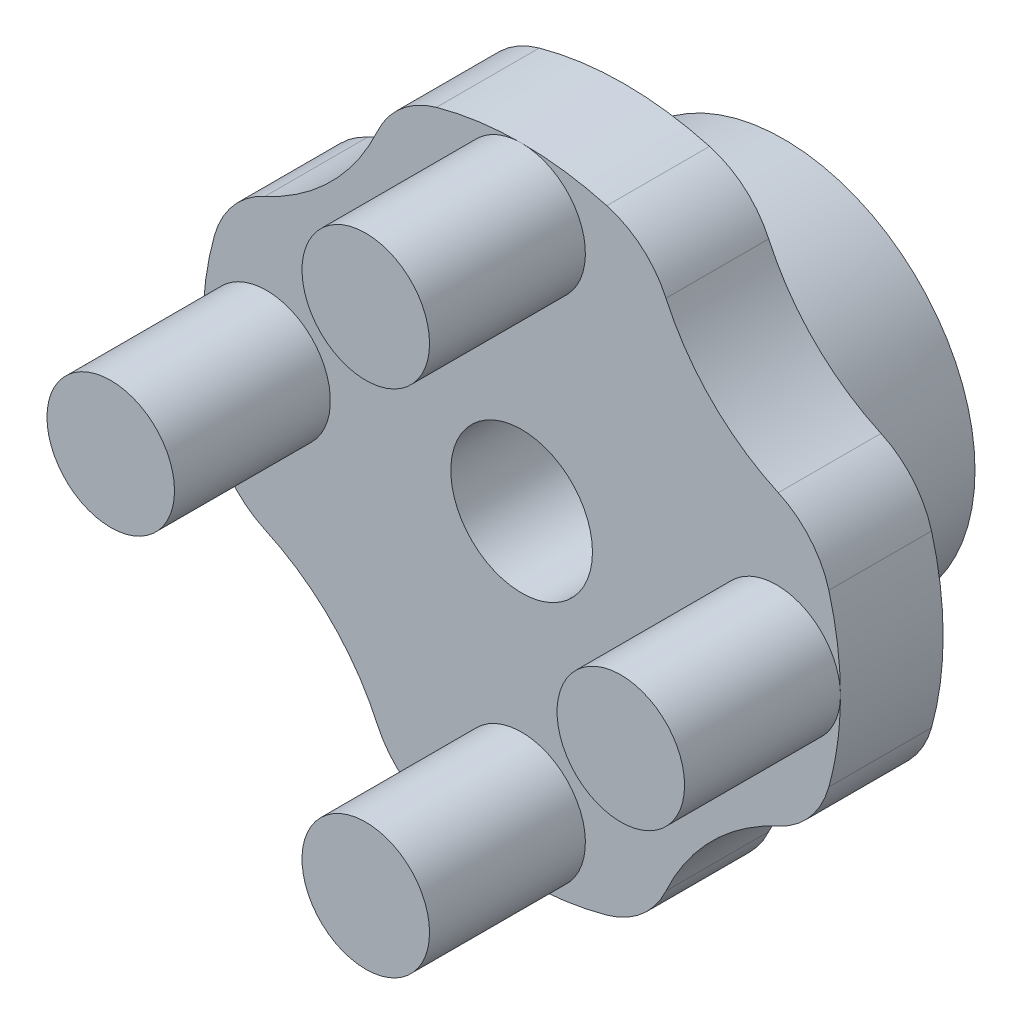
ISO-10303-21;
HEADER;
FILE_DESCRIPTION(('STEP AP214'),'2;1');
FILE_NAME('part.step','',(''),(''),'','','');
FILE_SCHEMA(('AUTOMOTIVE_DESIGN { 1 0 10303 214 1 1 1 1 }'));
ENDSEC;
DATA;
#1=APPLICATION_CONTEXT('core data for automotive mechanical design processes');
#2=APPLICATION_PROTOCOL_DEFINITION('international standard','automotive_design',2000,#1);
#3=PRODUCT_CONTEXT('',#1,'mechanical');
#4=PRODUCT('Part','Part','',(#3));
#5=PRODUCT_RELATED_PRODUCT_CATEGORY('part','',(#4));
#6=PRODUCT_DEFINITION_FORMATION('','',#4);
#7=PRODUCT_DEFINITION_CONTEXT('part definition',#1,'design');
#8=PRODUCT_DEFINITION('design','',#6,#7);
#9=PRODUCT_DEFINITION_SHAPE('','',#8);
#10=(LENGTH_UNIT() NAMED_UNIT(*) SI_UNIT(.MILLI.,.METRE.));
#11=(NAMED_UNIT(*) PLANE_ANGLE_UNIT() SI_UNIT($,.RADIAN.));
#12=(NAMED_UNIT(*) SI_UNIT($,.STERADIAN.) SOLID_ANGLE_UNIT());
#13=UNCERTAINTY_MEASURE_WITH_UNIT(LENGTH_MEASURE(1.E-05),#10,'distance_accuracy_value','');
#14=(GEOMETRIC_REPRESENTATION_CONTEXT(3) GLOBAL_UNCERTAINTY_ASSIGNED_CONTEXT((#13)) GLOBAL_UNIT_ASSIGNED_CONTEXT((#10,
#11,#12)) REPRESENTATION_CONTEXT('',''));
#15=CARTESIAN_POINT('',(0.,0.,0.));
#16=DIRECTION('',(0.,0.,1.));
#17=DIRECTION('',(1.,0.,0.));
#18=AXIS2_PLACEMENT_3D('',#15,#16,#17);
#19=CARTESIAN_POINT('',(0.,0.,90.));
#20=DIRECTION('',(0.,0.,1.));
#21=DIRECTION('',(1.,0.,0.));
#22=AXIS2_PLACEMENT_3D('',#19,#20,#21);
#23=CYLINDRICAL_SURFACE('',#22,45.);
#24=CARTESIAN_POINT('',(0.,0.,22.5));
#25=DIRECTION('',(0.,0.,1.));
#26=DIRECTION('',(1.,0.,0.));
#27=AXIS2_PLACEMENT_3D('',#24,#25,#26);
#28=CIRCLE('',#27,45.);
#29=CARTESIAN_POINT('',(-43.3644250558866,12.021923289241,22.5));
#30=VERTEX_POINT('',#29);
#31=CARTESIAN_POINT('',(-43.3644250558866,-12.0219232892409,22.5));
#32=VERTEX_POINT('',#31);
#33=EDGE_CURVE('E171',#30,#32,#28,.T.);
#34=ORIENTED_EDGE('',*,*,#33,.T.);
#35=DIRECTION('',(0.,0.,1.));
#36=VECTOR('',#35,1.);
#37=CARTESIAN_POINT('',(-43.3644250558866,-12.0219232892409,90.));
#38=LINE('',#37,#36);
#39=CARTESIAN_POINT('',(-43.3644250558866,-12.0219232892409,37.));
#40=VERTEX_POINT('',#39);
#41=EDGE_CURVE('E225',#32,#40,#38,.T.);
#42=ORIENTED_EDGE('',*,*,#41,.T.);
#43=CARTESIAN_POINT('',(0.,0.,37.));
#44=DIRECTION('',(0.,0.,1.));
#45=DIRECTION('',(1.,0.,0.));
#46=AXIS2_PLACEMENT_3D('',#43,#44,#45);
#47=CIRCLE('',#46,45.);
#48=CARTESIAN_POINT('',(-45.,0.,37.));
#49=VERTEX_POINT('',#48);
#50=EDGE_CURVE('E161',#49,#40,#47,.T.);
#51=ORIENTED_EDGE('',*,*,#50,.F.);
#52=CARTESIAN_POINT('',(-43.3644250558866,12.021923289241,37.));
#53=VERTEX_POINT('',#52);
#54=EDGE_CURVE('E157',#53,#49,#47,.T.);
#55=ORIENTED_EDGE('',*,*,#54,.F.);
#56=DIRECTION('',(0.,0.,1.));
#57=VECTOR('',#56,1.);
#58=CARTESIAN_POINT('',(-43.3644250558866,12.021923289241,90.));
#59=LINE('',#58,#57);
#60=EDGE_CURVE('E223',#53,#30,#59,.F.);
#61=ORIENTED_EDGE('',*,*,#60,.T.);
#62=EDGE_LOOP('',(#34,#42,#51,#55,#61));
#63=FACE_BOUND('',#62,.T.);
#64=ADVANCED_FACE('F14',(#63),#23,.T.);
#65=CARTESIAN_POINT('',(-45.,0.,37.));
#66=DIRECTION('',(0.,0.,-1.));
#67=DIRECTION('',(-1.,0.,0.));
#68=AXIS2_PLACEMENT_3D('',#65,#66,#67);
#69=PLANE('',#68);
#70=CARTESIAN_POINT('',(0.,0.,37.));
#71=DIRECTION('',(0.,0.,1.));
#72=DIRECTION('',(1.,0.,0.));
#73=AXIS2_PLACEMENT_3D('',#70,#71,#72);
#74=CIRCLE('',#73,10.);
#75=CARTESIAN_POINT('',(10.,0.,37.));
#76=VERTEX_POINT('',#75);
#77=EDGE_CURVE('E319',#76,#76,#74,.T.);
#78=ORIENTED_EDGE('',*,*,#77,.F.);
#79=EDGE_LOOP('',(#78));
#80=FACE_BOUND('',#79,.T.);
#81=CARTESIAN_POINT('',(0.,-45.,37.));
#82=VERTEX_POINT('',#81);
#83=CARTESIAN_POINT('',(12.021923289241,-43.3644250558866,37.));
#84=VERTEX_POINT('',#83);
#85=EDGE_CURVE('E147',#82,#84,#47,.T.);
#86=ORIENTED_EDGE('',*,*,#85,.T.);
#87=CARTESIAN_POINT('',(8.54892322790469,-30.836924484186,37.));
#88=DIRECTION('',(0.,0.,-1.));
#89=DIRECTION('',(-1.,0.,0.));
#90=AXIS2_PLACEMENT_3D('',#87,#88,#89);
#91=CIRCLE('',#90,13.);
#92=CARTESIAN_POINT('',(20.3785047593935,-36.2277500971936,37.));
#93=VERTEX_POINT('',#92);
#94=EDGE_CURVE('E246',#84,#93,#91,.F.);
#95=ORIENTED_EDGE('',*,*,#94,.T.);
#96=CARTESIAN_POINT('',(49.4974746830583,-49.4974746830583,37.));
#97=DIRECTION('',(0.,0.,1.));
#98=DIRECTION('',(1.,0.,0.));
#99=AXIS2_PLACEMENT_3D('',#96,#97,#98);
#100=CIRCLE('',#99,32.);
#101=CARTESIAN_POINT('',(36.2277500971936,-20.3785047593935,37.));
#102=VERTEX_POINT('',#101);
#103=EDGE_CURVE('E285',#102,#93,#100,.T.);
#104=ORIENTED_EDGE('',*,*,#103,.F.);
#105=CARTESIAN_POINT('',(30.836924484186,-8.54892322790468,37.));
#106=DIRECTION('',(0.,0.,-1.));
#107=DIRECTION('',(-1.,0.,0.));
#108=AXIS2_PLACEMENT_3D('',#105,#106,#107);
#109=CIRCLE('',#108,13.);
#110=CARTESIAN_POINT('',(43.3644250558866,-12.021923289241,37.));
#111=VERTEX_POINT('',#110);
#112=EDGE_CURVE('E146',#102,#111,#109,.F.);
#113=ORIENTED_EDGE('',*,*,#112,.T.);
#114=CARTESIAN_POINT('',(45.,0.,37.));
#115=VERTEX_POINT('',#114);
#116=EDGE_CURVE('E139',#111,#115,#47,.T.);
#117=ORIENTED_EDGE('',*,*,#116,.T.);
#118=CARTESIAN_POINT('',(36.,0.,37.));
#119=DIRECTION('',(0.,0.,1.));
#120=DIRECTION('',(1.,0.,0.));
#121=AXIS2_PLACEMENT_3D('',#118,#119,#120);
#122=CIRCLE('',#121,9.);
#123=EDGE_CURVE('E144',#115,#115,#122,.T.);
#124=ORIENTED_EDGE('',*,*,#123,.F.);
#125=CARTESIAN_POINT('',(43.3644250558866,12.021923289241,37.));
#126=VERTEX_POINT('',#125);
#127=EDGE_CURVE('E148',#115,#126,#47,.T.);
#128=ORIENTED_EDGE('',*,*,#127,.T.);
#129=CARTESIAN_POINT('',(30.836924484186,8.5489232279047,37.));
#130=DIRECTION('',(0.,0.,-1.));
#131=DIRECTION('',(-1.,0.,0.));
#132=AXIS2_PLACEMENT_3D('',#129,#130,#131);
#133=CIRCLE('',#132,13.);
#134=CARTESIAN_POINT('',(36.2277500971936,20.3785047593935,37.));
#135=VERTEX_POINT('',#134);
#136=EDGE_CURVE('E207',#126,#135,#133,.F.);
#137=ORIENTED_EDGE('',*,*,#136,.T.);
#138=CARTESIAN_POINT('',(49.4974746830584,49.4974746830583,37.));
#139=DIRECTION('',(0.,0.,-1.));
#140=DIRECTION('',(-1.,0.,0.));
#141=AXIS2_PLACEMENT_3D('',#138,#139,#140);
#142=CIRCLE('',#141,32.);
#143=CARTESIAN_POINT('',(20.3785047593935,36.2277500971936,37.));
#144=VERTEX_POINT('',#143);
#145=EDGE_CURVE('E290',#135,#144,#142,.T.);
#146=ORIENTED_EDGE('',*,*,#145,.T.);
#147=CARTESIAN_POINT('',(8.5489232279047,30.836924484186,37.));
#148=DIRECTION('',(0.,0.,-1.));
#149=DIRECTION('',(-1.,0.,0.));
#150=AXIS2_PLACEMENT_3D('',#147,#148,#149);
#151=CIRCLE('',#150,13.);
#152=CARTESIAN_POINT('',(12.021923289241,43.3644250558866,37.));
#153=VERTEX_POINT('',#152);
#154=EDGE_CURVE('E203',#144,#153,#151,.F.);
#155=ORIENTED_EDGE('',*,*,#154,.T.);
#156=CARTESIAN_POINT('',(0.,45.,37.));
#157=VERTEX_POINT('',#156);
#158=EDGE_CURVE('E155',#153,#157,#47,.T.);
#159=ORIENTED_EDGE('',*,*,#158,.T.);
#160=CARTESIAN_POINT('',(0.,36.,37.));
#161=DIRECTION('',(0.,0.,1.));
#162=DIRECTION('',(1.,0.,0.));
#163=AXIS2_PLACEMENT_3D('',#160,#161,#162);
#164=CIRCLE('',#163,9.);
#165=EDGE_CURVE('E277',#157,#157,#164,.T.);
#166=ORIENTED_EDGE('',*,*,#165,.F.);
#167=CARTESIAN_POINT('',(-12.021923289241,43.3644250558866,37.));
#168=VERTEX_POINT('',#167);
#169=EDGE_CURVE('E156',#157,#168,#47,.T.);
#170=ORIENTED_EDGE('',*,*,#169,.T.);
#171=CARTESIAN_POINT('',(-8.54892322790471,30.836924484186,37.));
#172=DIRECTION('',(0.,0.,-1.));
#173=DIRECTION('',(-1.,0.,0.));
#174=AXIS2_PLACEMENT_3D('',#171,#172,#173);
#175=CIRCLE('',#174,13.);
#176=CARTESIAN_POINT('',(-20.3785047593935,36.2277500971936,37.));
#177=VERTEX_POINT('',#176);
#178=EDGE_CURVE('E202',#168,#177,#175,.F.);
#179=ORIENTED_EDGE('',*,*,#178,.T.);
#180=CARTESIAN_POINT('',(-49.4974746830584,49.4974746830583,37.));
#181=DIRECTION('',(0.,0.,1.));
#182=DIRECTION('',(1.,0.,0.));
#183=AXIS2_PLACEMENT_3D('',#180,#181,#182);
#184=CIRCLE('',#183,32.);
#185=CARTESIAN_POINT('',(-36.2277500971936,20.3785047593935,37.));
#186=VERTEX_POINT('',#185);
#187=EDGE_CURVE('E302',#186,#177,#184,.T.);
#188=ORIENTED_EDGE('',*,*,#187,.F.);
#189=CARTESIAN_POINT('',(-30.836924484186,8.5489232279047,37.));
#190=DIRECTION('',(0.,0.,-1.));
#191=DIRECTION('',(-1.,0.,0.));
#192=AXIS2_PLACEMENT_3D('',#189,#190,#191);
#193=CIRCLE('',#192,13.);
#194=EDGE_CURVE('E309',#186,#53,#193,.F.);
#195=ORIENTED_EDGE('',*,*,#194,.T.);
#196=ORIENTED_EDGE('',*,*,#54,.T.);
#197=CARTESIAN_POINT('',(-36.,0.,37.));
#198=DIRECTION('',(0.,0.,1.));
#199=DIRECTION('',(1.,0.,0.));
#200=AXIS2_PLACEMENT_3D('',#197,#198,#199);
#201=CIRCLE('',#200,9.);
#202=EDGE_CURVE('E269',#49,#49,#201,.T.);
#203=ORIENTED_EDGE('',*,*,#202,.F.);
#204=ORIENTED_EDGE('',*,*,#50,.T.);
#205=CARTESIAN_POINT('',(-30.836924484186,-8.54892322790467,37.));
#206=DIRECTION('',(0.,0.,-1.));
#207=DIRECTION('',(-1.,0.,0.));
#208=AXIS2_PLACEMENT_3D('',#205,#206,#207);
#209=CIRCLE('',#208,13.);
#210=CARTESIAN_POINT('',(-36.2277500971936,-20.3785047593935,37.));
#211=VERTEX_POINT('',#210);
#212=EDGE_CURVE('E230',#40,#211,#209,.F.);
#213=ORIENTED_EDGE('',*,*,#212,.T.);
#214=CARTESIAN_POINT('',(-49.4974746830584,-49.4974746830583,37.));
#215=DIRECTION('',(0.,0.,-1.));
#216=DIRECTION('',(-1.,0.,0.));
#217=AXIS2_PLACEMENT_3D('',#214,#215,#216);
#218=CIRCLE('',#217,32.);
#219=CARTESIAN_POINT('',(-20.3785047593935,-36.2277500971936,37.));
#220=VERTEX_POINT('',#219);
#221=EDGE_CURVE('E296',#211,#220,#218,.T.);
#222=ORIENTED_EDGE('',*,*,#221,.T.);
#223=CARTESIAN_POINT('',(-8.54892322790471,-30.836924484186,37.));
#224=DIRECTION('',(0.,0.,-1.));
#225=DIRECTION('',(-1.,0.,0.));
#226=AXIS2_PLACEMENT_3D('',#223,#224,#225);
#227=CIRCLE('',#226,13.);
#228=CARTESIAN_POINT('',(-12.021923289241,-43.3644250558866,37.));
#229=VERTEX_POINT('',#228);
#230=EDGE_CURVE('E228',#220,#229,#227,.F.);
#231=ORIENTED_EDGE('',*,*,#230,.T.);
#232=EDGE_CURVE('E150',#229,#82,#47,.T.);
#233=ORIENTED_EDGE('',*,*,#232,.T.);
#234=CARTESIAN_POINT('',(0.,-36.,37.));
#235=DIRECTION('',(0.,0.,1.));
#236=DIRECTION('',(1.,0.,0.));
#237=AXIS2_PLACEMENT_3D('',#234,#235,#236);
#238=CIRCLE('',#237,9.);
#239=EDGE_CURVE('E263',#82,#82,#238,.T.);
#240=ORIENTED_EDGE('',*,*,#239,.F.);
#241=EDGE_LOOP('',(#86,#95,#104,#113,#117,#124,#128,#137,#146,#155,#159,#166,#170,#179,#188,
#195,#196,#203,#204,#213,#222,#231,#233,#240));
#242=FACE_BOUND('',#241,.T.);
#243=ADVANCED_FACE('F16',(#80,#242),#69,.F.);
#244=CARTESIAN_POINT('',(-28.5,0.,22.5));
#245=DIRECTION('',(0.,0.,1.));
#246=DIRECTION('',(1.,0.,0.));
#247=AXIS2_PLACEMENT_3D('',#244,#245,#246);
#248=PLANE('',#247);
#249=CARTESIAN_POINT('',(0.,0.,22.5));
#250=DIRECTION('',(0.,0.,1.));
#251=DIRECTION('',(1.,0.,0.));
#252=AXIS2_PLACEMENT_3D('',#249,#250,#251);
#253=CIRCLE('',#252,28.5);
#254=CARTESIAN_POINT('',(28.5,0.,22.5));
#255=VERTEX_POINT('',#254);
#256=EDGE_CURVE('E180',#255,#255,#253,.T.);
#257=ORIENTED_EDGE('',*,*,#256,.T.);
#258=EDGE_LOOP('',(#257));
#259=FACE_BOUND('',#258,.T.);
#260=CARTESIAN_POINT('',(49.4974746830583,-49.4974746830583,22.5));
#261=DIRECTION('',(0.,0.,1.));
#262=DIRECTION('',(1.,0.,0.));
#263=AXIS2_PLACEMENT_3D('',#260,#261,#262);
#264=CIRCLE('',#263,32.);
#265=CARTESIAN_POINT('',(36.2277500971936,-20.3785047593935,22.5));
#266=VERTEX_POINT('',#265);
#267=CARTESIAN_POINT('',(20.3785047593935,-36.2277500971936,22.5));
#268=VERTEX_POINT('',#267);
#269=EDGE_CURVE('E256',#266,#268,#264,.T.);
#270=ORIENTED_EDGE('',*,*,#269,.T.);
#271=CARTESIAN_POINT('',(8.54892322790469,-30.836924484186,22.5));
#272=DIRECTION('',(0.,0.,1.));
#273=DIRECTION('',(1.,0.,0.));
#274=AXIS2_PLACEMENT_3D('',#271,#272,#273);
#275=CIRCLE('',#274,13.);
#276=CARTESIAN_POINT('',(12.021923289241,-43.3644250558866,22.5));
#277=VERTEX_POINT('',#276);
#278=EDGE_CURVE('E22',#268,#277,#275,.F.);
#279=ORIENTED_EDGE('',*,*,#278,.T.);
#280=CARTESIAN_POINT('',(-12.021923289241,-43.3644250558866,22.5));
#281=VERTEX_POINT('',#280);
#282=EDGE_CURVE('E167',#281,#277,#28,.T.);
#283=ORIENTED_EDGE('',*,*,#282,.F.);
#284=CARTESIAN_POINT('',(-8.54892322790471,-30.836924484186,22.5));
#285=DIRECTION('',(0.,0.,1.));
#286=DIRECTION('',(1.,0.,0.));
#287=AXIS2_PLACEMENT_3D('',#284,#285,#286);
#288=CIRCLE('',#287,13.);
#289=CARTESIAN_POINT('',(-20.3785047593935,-36.2277500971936,22.5));
#290=VERTEX_POINT('',#289);
#291=EDGE_CURVE('E237',#281,#290,#288,.F.);
#292=ORIENTED_EDGE('',*,*,#291,.T.);
#293=CARTESIAN_POINT('',(-49.4974746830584,-49.4974746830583,22.5));
#294=DIRECTION('',(0.,0.,1.));
#295=DIRECTION('',(1.,0.,0.));
#296=AXIS2_PLACEMENT_3D('',#293,#294,#295);
#297=CIRCLE('',#296,32.);
#298=CARTESIAN_POINT('',(-36.2277500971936,-20.3785047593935,22.5));
#299=VERTEX_POINT('',#298);
#300=EDGE_CURVE('E293',#299,#290,#297,.F.);
#301=ORIENTED_EDGE('',*,*,#300,.F.);
#302=CARTESIAN_POINT('',(-30.836924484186,-8.54892322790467,22.5));
#303=DIRECTION('',(0.,0.,1.));
#304=DIRECTION('',(1.,0.,0.));
#305=AXIS2_PLACEMENT_3D('',#302,#303,#304);
#306=CIRCLE('',#305,13.);
#307=EDGE_CURVE('E239',#299,#32,#306,.F.);
#308=ORIENTED_EDGE('',*,*,#307,.T.);
#309=ORIENTED_EDGE('',*,*,#33,.F.);
#310=CARTESIAN_POINT('',(-30.836924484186,8.5489232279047,22.5));
#311=DIRECTION('',(0.,0.,1.));
#312=DIRECTION('',(1.,0.,0.));
#313=AXIS2_PLACEMENT_3D('',#310,#311,#312);
#314=CIRCLE('',#313,13.);
#315=CARTESIAN_POINT('',(-36.2277500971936,20.3785047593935,22.5));
#316=VERTEX_POINT('',#315);
#317=EDGE_CURVE('E205',#30,#316,#314,.F.);
#318=ORIENTED_EDGE('',*,*,#317,.T.);
#319=CARTESIAN_POINT('',(-49.4974746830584,49.4974746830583,22.5));
#320=DIRECTION('',(0.,0.,1.));
#321=DIRECTION('',(1.,0.,0.));
#322=AXIS2_PLACEMENT_3D('',#319,#320,#321);
#323=CIRCLE('',#322,32.);
#324=CARTESIAN_POINT('',(-20.3785047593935,36.2277500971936,22.5));
#325=VERTEX_POINT('',#324);
#326=EDGE_CURVE('E299',#316,#325,#323,.T.);
#327=ORIENTED_EDGE('',*,*,#326,.T.);
#328=CARTESIAN_POINT('',(-8.54892322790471,30.836924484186,22.5));
#329=DIRECTION('',(0.,0.,1.));
#330=DIRECTION('',(1.,0.,0.));
#331=AXIS2_PLACEMENT_3D('',#328,#329,#330);
#332=CIRCLE('',#331,13.);
#333=CARTESIAN_POINT('',(-12.021923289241,43.3644250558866,22.5));
#334=VERTEX_POINT('',#333);
#335=EDGE_CURVE('E201',#325,#334,#332,.F.);
#336=ORIENTED_EDGE('',*,*,#335,.T.);
#337=CARTESIAN_POINT('',(12.021923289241,43.3644250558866,22.5));
#338=VERTEX_POINT('',#337);
#339=EDGE_CURVE('E178',#338,#334,#28,.T.);
#340=ORIENTED_EDGE('',*,*,#339,.F.);
#341=CARTESIAN_POINT('',(8.5489232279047,30.836924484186,22.5));
#342=DIRECTION('',(0.,0.,1.));
#343=DIRECTION('',(1.,0.,0.));
#344=AXIS2_PLACEMENT_3D('',#341,#342,#343);
#345=CIRCLE('',#344,13.);
#346=CARTESIAN_POINT('',(20.3785047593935,36.2277500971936,22.5));
#347=VERTEX_POINT('',#346);
#348=EDGE_CURVE('E215',#338,#347,#345,.F.);
#349=ORIENTED_EDGE('',*,*,#348,.T.);
#350=CARTESIAN_POINT('',(49.4974746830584,49.4974746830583,22.5));
#351=DIRECTION('',(0.,0.,1.));
#352=DIRECTION('',(1.,0.,0.));
#353=AXIS2_PLACEMENT_3D('',#350,#351,#352);
#354=CIRCLE('',#353,32.);
#355=CARTESIAN_POINT('',(36.2277500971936,20.3785047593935,22.5));
#356=VERTEX_POINT('',#355);
#357=EDGE_CURVE('E287',#356,#347,#354,.F.);
#358=ORIENTED_EDGE('',*,*,#357,.F.);
#359=CARTESIAN_POINT('',(30.836924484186,8.5489232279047,22.5));
#360=DIRECTION('',(0.,0.,1.));
#361=DIRECTION('',(1.,0.,0.));
#362=AXIS2_PLACEMENT_3D('',#359,#360,#361);
#363=CIRCLE('',#362,13.);
#364=CARTESIAN_POINT('',(43.3644250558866,12.021923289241,22.5));
#365=VERTEX_POINT('',#364);
#366=EDGE_CURVE('E213',#356,#365,#363,.F.);
#367=ORIENTED_EDGE('',*,*,#366,.T.);
#368=CARTESIAN_POINT('',(43.3644250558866,-12.021923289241,22.5));
#369=VERTEX_POINT('',#368);
#370=EDGE_CURVE('E172',#369,#365,#28,.T.);
#371=ORIENTED_EDGE('',*,*,#370,.F.);
#372=CARTESIAN_POINT('',(30.836924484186,-8.54892322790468,22.5));
#373=DIRECTION('',(0.,0.,1.));
#374=DIRECTION('',(1.,0.,0.));
#375=AXIS2_PLACEMENT_3D('',#372,#373,#374);
#376=CIRCLE('',#375,13.);
#377=EDGE_CURVE('E252',#369,#266,#376,.F.);
#378=ORIENTED_EDGE('',*,*,#377,.T.);
#379=EDGE_LOOP('',(#270,#279,#283,#292,#301,#308,#309,#318,#327,#336,#340,#349,#358,#367,#371,#378));
#380=FACE_BOUND('',#379,.T.);
#381=ADVANCED_FACE('F254',(#259,#380),#248,.F.);
#382=ORIENTED_EDGE('',*,*,#282,.T.);
#383=DIRECTION('',(0.,0.,1.));
#384=VECTOR('',#383,1.);
#385=CARTESIAN_POINT('',(12.021923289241,-43.3644250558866,90.));
#386=LINE('',#385,#384);
#387=EDGE_CURVE('E243',#277,#84,#386,.T.);
#388=ORIENTED_EDGE('',*,*,#387,.T.);
#389=ORIENTED_EDGE('',*,*,#85,.F.);
#390=ORIENTED_EDGE('',*,*,#232,.F.);
#391=DIRECTION('',(0.,0.,1.));
#392=VECTOR('',#391,1.);
#393=CARTESIAN_POINT('',(-12.021923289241,-43.3644250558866,90.));
#394=LINE('',#393,#392);
#395=EDGE_CURVE('E241',#229,#281,#394,.F.);
#396=ORIENTED_EDGE('',*,*,#395,.T.);
#397=EDGE_LOOP('',(#382,#388,#389,#390,#396));
#398=FACE_BOUND('',#397,.T.);
#399=ADVANCED_FACE('F259',(#398),#23,.T.);
#400=ORIENTED_EDGE('',*,*,#158,.F.);
#401=DIRECTION('',(0.,0.,1.));
#402=VECTOR('',#401,1.);
#403=CARTESIAN_POINT('',(12.021923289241,43.3644250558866,90.));
#404=LINE('',#403,#402);
#405=EDGE_CURVE('E194',#153,#338,#404,.F.);
#406=ORIENTED_EDGE('',*,*,#405,.T.);
#407=ORIENTED_EDGE('',*,*,#339,.T.);
#408=DIRECTION('',(0.,0.,1.));
#409=VECTOR('',#408,1.);
#410=CARTESIAN_POINT('',(-12.021923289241,43.3644250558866,90.));
#411=LINE('',#410,#409);
#412=EDGE_CURVE('E192',#334,#168,#411,.T.);
#413=ORIENTED_EDGE('',*,*,#412,.T.);
#414=ORIENTED_EDGE('',*,*,#169,.F.);
#415=EDGE_LOOP('',(#400,#406,#407,#413,#414));
#416=FACE_BOUND('',#415,.T.);
#417=ADVANCED_FACE('F190',(#416),#23,.T.);
#418=ORIENTED_EDGE('',*,*,#116,.F.);
#419=DIRECTION('',(0.,0.,1.));
#420=VECTOR('',#419,1.);
#421=CARTESIAN_POINT('',(43.3644250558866,-12.021923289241,90.));
#422=LINE('',#421,#420);
#423=EDGE_CURVE('E9',#111,#369,#422,.F.);
#424=ORIENTED_EDGE('',*,*,#423,.T.);
#425=ORIENTED_EDGE('',*,*,#370,.T.);
#426=DIRECTION('',(0.,0.,1.));
#427=VECTOR('',#426,1.);
#428=CARTESIAN_POINT('',(43.3644250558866,12.021923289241,90.));
#429=LINE('',#428,#427);
#430=EDGE_CURVE('E154',#365,#126,#429,.T.);
#431=ORIENTED_EDGE('',*,*,#430,.T.);
#432=ORIENTED_EDGE('',*,*,#127,.F.);
#433=EDGE_LOOP('',(#418,#424,#425,#431,#432));
#434=FACE_BOUND('',#433,.T.);
#435=ADVANCED_FACE('F152',(#434),#23,.T.);
#436=CARTESIAN_POINT('',(0.,0.,90.));
#437=DIRECTION('',(0.,0.,1.));
#438=DIRECTION('',(1.,0.,0.));
#439=AXIS2_PLACEMENT_3D('',#436,#437,#438);
#440=CYLINDRICAL_SURFACE('',#439,10.);
#441=CARTESIAN_POINT('',(0.,0.,0.));
#442=DIRECTION('',(0.,0.,1.));
#443=DIRECTION('',(1.,0.,0.));
#444=AXIS2_PLACEMENT_3D('',#441,#442,#443);
#445=CIRCLE('',#444,10.);
#446=CARTESIAN_POINT('',(10.,0.,0.));
#447=VERTEX_POINT('',#446);
#448=EDGE_CURVE('E322',#447,#447,#445,.T.);
#449=ORIENTED_EDGE('',*,*,#448,.F.);
#450=EDGE_LOOP('',(#449));
#451=FACE_BOUND('',#450,.T.);
#452=ORIENTED_EDGE('',*,*,#77,.T.);
#453=EDGE_LOOP('',(#452));
#454=FACE_BOUND('',#453,.T.);
#455=ADVANCED_FACE('F334',(#451,#454),#440,.F.);
#456=CARTESIAN_POINT('',(-10.,0.,0.));
#457=DIRECTION('',(0.,0.,1.));
#458=DIRECTION('',(1.,0.,0.));
#459=AXIS2_PLACEMENT_3D('',#456,#457,#458);
#460=PLANE('',#459);
#461=CARTESIAN_POINT('',(0.,0.,0.));
#462=DIRECTION('',(0.,0.,1.));
#463=DIRECTION('',(1.,0.,0.));
#464=AXIS2_PLACEMENT_3D('',#461,#462,#463);
#465=CIRCLE('',#464,27.);
#466=CARTESIAN_POINT('',(27.,0.,0.));
#467=VERTEX_POINT('',#466);
#468=EDGE_CURVE('E183',#467,#467,#465,.T.);
#469=ORIENTED_EDGE('',*,*,#468,.F.);
#470=EDGE_LOOP('',(#469));
#471=FACE_BOUND('',#470,.T.);
#472=ORIENTED_EDGE('',*,*,#448,.T.);
#473=EDGE_LOOP('',(#472));
#474=FACE_BOUND('',#473,.T.);
#475=ADVANCED_FACE('F331',(#471,#474),#460,.F.);
#476=CARTESIAN_POINT('',(0.,0.,22.5));
#477=DIRECTION('',(0.,0.,1.));
#478=DIRECTION('',(1.,0.,0.));
#479=AXIS2_PLACEMENT_3D('',#476,#477,#478);
#480=CONICAL_SURFACE('',#479,28.5,0.0665681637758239);
#481=ORIENTED_EDGE('',*,*,#468,.T.);
#482=EDGE_LOOP('',(#481));
#483=FACE_BOUND('',#482,.T.);
#484=ORIENTED_EDGE('',*,*,#256,.F.);
#485=EDGE_LOOP('',(#484));
#486=FACE_BOUND('',#485,.T.);
#487=ADVANCED_FACE('F328',(#483,#486),#480,.T.);
#488=CARTESIAN_POINT('',(0.,-36.,59.));
#489=DIRECTION('',(0.,0.,-1.));
#490=DIRECTION('',(-1.,0.,0.));
#491=AXIS2_PLACEMENT_3D('',#488,#489,#490);
#492=CYLINDRICAL_SURFACE('',#491,9.);
#493=CARTESIAN_POINT('',(0.,-36.,59.));
#494=DIRECTION('',(0.,0.,1.));
#495=DIRECTION('',(1.,0.,0.));
#496=AXIS2_PLACEMENT_3D('',#493,#494,#495);
#497=CIRCLE('',#496,9.);
#498=CARTESIAN_POINT('',(9.,-36.,59.));
#499=VERTEX_POINT('',#498);
#500=EDGE_CURVE('E166',#499,#499,#497,.T.);
#501=ORIENTED_EDGE('',*,*,#500,.F.);
#502=EDGE_LOOP('',(#501));
#503=FACE_BOUND('',#502,.T.);
#504=ORIENTED_EDGE('',*,*,#239,.T.);
#505=EDGE_LOOP('',(#504));
#506=FACE_BOUND('',#505,.T.);
#507=ADVANCED_FACE('F383',(#503,#506),#492,.T.);
#508=CARTESIAN_POINT('',(0.,-36.,59.));
#509=DIRECTION('',(0.,0.,1.));
#510=DIRECTION('',(1.,0.,0.));
#511=AXIS2_PLACEMENT_3D('',#508,#509,#510);
#512=PLANE('',#511);
#513=ORIENTED_EDGE('',*,*,#500,.T.);
#514=EDGE_LOOP('',(#513));
#515=FACE_BOUND('',#514,.T.);
#516=ADVANCED_FACE('F385',(#515),#512,.T.);
#517=CARTESIAN_POINT('',(-36.,0.,59.));
#518=DIRECTION('',(0.,0.,-1.));
#519=DIRECTION('',(-1.,0.,0.));
#520=AXIS2_PLACEMENT_3D('',#517,#518,#519);
#521=CYLINDRICAL_SURFACE('',#520,9.);
#522=CARTESIAN_POINT('',(-36.,0.,59.));
#523=DIRECTION('',(0.,0.,1.));
#524=DIRECTION('',(1.,0.,0.));
#525=AXIS2_PLACEMENT_3D('',#522,#523,#524);
#526=CIRCLE('',#525,9.);
#527=CARTESIAN_POINT('',(-27.,0.,59.));
#528=VERTEX_POINT('',#527);
#529=EDGE_CURVE('E265',#528,#528,#526,.T.);
#530=ORIENTED_EDGE('',*,*,#529,.F.);
#531=EDGE_LOOP('',(#530));
#532=FACE_BOUND('',#531,.T.);
#533=ORIENTED_EDGE('',*,*,#202,.T.);
#534=EDGE_LOOP('',(#533));
#535=FACE_BOUND('',#534,.T.);
#536=ADVANCED_FACE('F400',(#532,#535),#521,.T.);
#537=CARTESIAN_POINT('',(-36.,0.,59.));
#538=DIRECTION('',(0.,0.,1.));
#539=DIRECTION('',(1.,0.,0.));
#540=AXIS2_PLACEMENT_3D('',#537,#538,#539);
#541=PLANE('',#540);
#542=ORIENTED_EDGE('',*,*,#529,.T.);
#543=EDGE_LOOP('',(#542));
#544=FACE_BOUND('',#543,.T.);
#545=ADVANCED_FACE('F393',(#544),#541,.T.);
#546=CARTESIAN_POINT('',(0.,36.,59.));
#547=DIRECTION('',(0.,0.,-1.));
#548=DIRECTION('',(-1.,0.,0.));
#549=AXIS2_PLACEMENT_3D('',#546,#547,#548);
#550=CYLINDRICAL_SURFACE('',#549,9.);
#551=CARTESIAN_POINT('',(0.,36.,59.));
#552=DIRECTION('',(0.,0.,1.));
#553=DIRECTION('',(1.,0.,0.));
#554=AXIS2_PLACEMENT_3D('',#551,#552,#553);
#555=CIRCLE('',#554,9.);
#556=CARTESIAN_POINT('',(9.,36.,59.));
#557=VERTEX_POINT('',#556);
#558=EDGE_CURVE('E274',#557,#557,#555,.T.);
#559=ORIENTED_EDGE('',*,*,#558,.F.);
#560=EDGE_LOOP('',(#559));
#561=FACE_BOUND('',#560,.T.);
#562=ORIENTED_EDGE('',*,*,#165,.T.);
#563=EDGE_LOOP('',(#562));
#564=FACE_BOUND('',#563,.T.);
#565=ADVANCED_FACE('F418',(#561,#564),#550,.T.);
#566=CARTESIAN_POINT('',(0.,36.,59.));
#567=DIRECTION('',(0.,0.,1.));
#568=DIRECTION('',(1.,0.,0.));
#569=AXIS2_PLACEMENT_3D('',#566,#567,#568);
#570=PLANE('',#569);
#571=ORIENTED_EDGE('',*,*,#558,.T.);
#572=EDGE_LOOP('',(#571));
#573=FACE_BOUND('',#572,.T.);
#574=ADVANCED_FACE('F411',(#573),#570,.T.);
#575=CARTESIAN_POINT('',(36.,0.,59.));
#576=DIRECTION('',(0.,0.,-1.));
#577=DIRECTION('',(-1.,0.,0.));
#578=AXIS2_PLACEMENT_3D('',#575,#576,#577);
#579=CYLINDRICAL_SURFACE('',#578,9.);
#580=CARTESIAN_POINT('',(36.,0.,59.));
#581=DIRECTION('',(0.,0.,1.));
#582=DIRECTION('',(1.,0.,0.));
#583=AXIS2_PLACEMENT_3D('',#580,#581,#582);
#584=CIRCLE('',#583,9.);
#585=CARTESIAN_POINT('',(45.,0.,59.));
#586=VERTEX_POINT('',#585);
#587=EDGE_CURVE('E280',#586,#586,#584,.T.);
#588=ORIENTED_EDGE('',*,*,#587,.F.);
#589=EDGE_LOOP('',(#588));
#590=FACE_BOUND('',#589,.T.);
#591=ORIENTED_EDGE('',*,*,#123,.T.);
#592=EDGE_LOOP('',(#591));
#593=FACE_BOUND('',#592,.T.);
#594=ADVANCED_FACE('F436',(#590,#593),#579,.T.);
#595=CARTESIAN_POINT('',(36.,0.,59.));
#596=DIRECTION('',(0.,0.,1.));
#597=DIRECTION('',(1.,0.,0.));
#598=AXIS2_PLACEMENT_3D('',#595,#596,#597);
#599=PLANE('',#598);
#600=ORIENTED_EDGE('',*,*,#587,.T.);
#601=EDGE_LOOP('',(#600));
#602=FACE_BOUND('',#601,.T.);
#603=ADVANCED_FACE('F429',(#602),#599,.T.);
#604=CARTESIAN_POINT('',(49.4974746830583,-49.4974746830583,0.));
#605=DIRECTION('',(0.,0.,1.));
#606=DIRECTION('',(1.,0.,0.));
#607=AXIS2_PLACEMENT_3D('',#604,#605,#606);
#608=CYLINDRICAL_SURFACE('',#607,32.);
#609=ORIENTED_EDGE('',*,*,#103,.T.);
#610=DIRECTION('',(0.,0.,1.));
#611=VECTOR('',#610,1.);
#612=CARTESIAN_POINT('',(20.3785047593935,-36.2277500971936,0.));
#613=LINE('',#612,#611);
#614=EDGE_CURVE('E35',#93,#268,#613,.F.);
#615=ORIENTED_EDGE('',*,*,#614,.T.);
#616=ORIENTED_EDGE('',*,*,#269,.F.);
#617=DIRECTION('',(0.,0.,1.));
#618=VECTOR('',#617,1.);
#619=CARTESIAN_POINT('',(36.2277500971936,-20.3785047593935,0.));
#620=LINE('',#619,#618);
#621=EDGE_CURVE('E248',#266,#102,#620,.T.);
#622=ORIENTED_EDGE('',*,*,#621,.T.);
#623=EDGE_LOOP('',(#609,#615,#616,#622));
#624=FACE_BOUND('',#623,.T.);
#625=ADVANCED_FACE('F447',(#624),#608,.F.);
#626=CARTESIAN_POINT('',(49.4974746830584,49.4974746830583,0.));
#627=DIRECTION('',(0.,0.,1.));
#628=DIRECTION('',(1.,0.,0.));
#629=AXIS2_PLACEMENT_3D('',#626,#627,#628);
#630=CYLINDRICAL_SURFACE('',#629,32.);
#631=ORIENTED_EDGE('',*,*,#357,.T.);
#632=DIRECTION('',(0.,0.,1.));
#633=VECTOR('',#632,1.);
#634=CARTESIAN_POINT('',(20.3785047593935,36.2277500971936,0.));
#635=LINE('',#634,#633);
#636=EDGE_CURVE('E312',#347,#144,#635,.T.);
#637=ORIENTED_EDGE('',*,*,#636,.T.);
#638=ORIENTED_EDGE('',*,*,#145,.F.);
#639=DIRECTION('',(0.,0.,1.));
#640=VECTOR('',#639,1.);
#641=CARTESIAN_POINT('',(36.2277500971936,20.3785047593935,0.));
#642=LINE('',#641,#640);
#643=EDGE_CURVE('E317',#135,#356,#642,.F.);
#644=ORIENTED_EDGE('',*,*,#643,.T.);
#645=EDGE_LOOP('',(#631,#637,#638,#644));
#646=FACE_BOUND('',#645,.T.);
#647=ADVANCED_FACE('F462',(#646),#630,.F.);
#648=CARTESIAN_POINT('',(-49.4974746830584,-49.4974746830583,0.));
#649=DIRECTION('',(0.,0.,1.));
#650=DIRECTION('',(1.,0.,0.));
#651=AXIS2_PLACEMENT_3D('',#648,#649,#650);
#652=CYLINDRICAL_SURFACE('',#651,32.);
#653=ORIENTED_EDGE('',*,*,#221,.F.);
#654=DIRECTION('',(0.,0.,1.));
#655=VECTOR('',#654,1.);
#656=CARTESIAN_POINT('',(-36.2277500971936,-20.3785047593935,0.));
#657=LINE('',#656,#655);
#658=EDGE_CURVE('E235',#211,#299,#657,.F.);
#659=ORIENTED_EDGE('',*,*,#658,.T.);
#660=ORIENTED_EDGE('',*,*,#300,.T.);
#661=DIRECTION('',(0.,0.,1.));
#662=VECTOR('',#661,1.);
#663=CARTESIAN_POINT('',(-20.3785047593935,-36.2277500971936,0.));
#664=LINE('',#663,#662);
#665=EDGE_CURVE('E232',#290,#220,#664,.T.);
#666=ORIENTED_EDGE('',*,*,#665,.T.);
#667=EDGE_LOOP('',(#653,#659,#660,#666));
#668=FACE_BOUND('',#667,.T.);
#669=ADVANCED_FACE('F470',(#668),#652,.F.);
#670=CARTESIAN_POINT('',(-49.4974746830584,49.4974746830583,0.));
#671=DIRECTION('',(0.,0.,1.));
#672=DIRECTION('',(1.,0.,0.));
#673=AXIS2_PLACEMENT_3D('',#670,#671,#672);
#674=CYLINDRICAL_SURFACE('',#673,32.);
#675=ORIENTED_EDGE('',*,*,#187,.T.);
#676=DIRECTION('',(0.,0.,1.));
#677=VECTOR('',#676,1.);
#678=CARTESIAN_POINT('',(-20.3785047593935,36.2277500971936,0.));
#679=LINE('',#678,#677);
#680=EDGE_CURVE('E221',#177,#325,#679,.F.);
#681=ORIENTED_EDGE('',*,*,#680,.T.);
#682=ORIENTED_EDGE('',*,*,#326,.F.);
#683=DIRECTION('',(0.,0.,1.));
#684=VECTOR('',#683,1.);
#685=CARTESIAN_POINT('',(-36.2277500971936,20.3785047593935,0.));
#686=LINE('',#685,#684);
#687=EDGE_CURVE('E218',#316,#186,#686,.T.);
#688=ORIENTED_EDGE('',*,*,#687,.T.);
#689=EDGE_LOOP('',(#675,#681,#682,#688));
#690=FACE_BOUND('',#689,.T.);
#691=ADVANCED_FACE('F306',(#690),#674,.F.);
#692=CARTESIAN_POINT('',(8.5489232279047,30.836924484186,90.));
#693=DIRECTION('',(0.,0.,-1.));
#694=DIRECTION('',(-1.,0.,0.));
#695=AXIS2_PLACEMENT_3D('',#692,#693,#694);
#696=CYLINDRICAL_SURFACE('',#695,13.);
#697=ORIENTED_EDGE('',*,*,#348,.F.);
#698=ORIENTED_EDGE('',*,*,#405,.F.);
#699=ORIENTED_EDGE('',*,*,#154,.F.);
#700=ORIENTED_EDGE('',*,*,#636,.F.);
#701=EDGE_LOOP('',(#697,#698,#699,#700));
#702=FACE_BOUND('',#701,.T.);
#703=ADVANCED_FACE('F487',(#702),#696,.T.);
#704=CARTESIAN_POINT('',(30.836924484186,8.5489232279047,0.));
#705=DIRECTION('',(0.,0.,-1.));
#706=DIRECTION('',(-1.,0.,0.));
#707=AXIS2_PLACEMENT_3D('',#704,#705,#706);
#708=CYLINDRICAL_SURFACE('',#707,13.);
#709=ORIENTED_EDGE('',*,*,#366,.F.);
#710=ORIENTED_EDGE('',*,*,#643,.F.);
#711=ORIENTED_EDGE('',*,*,#136,.F.);
#712=ORIENTED_EDGE('',*,*,#430,.F.);
#713=EDGE_LOOP('',(#709,#710,#711,#712));
#714=FACE_BOUND('',#713,.T.);
#715=ADVANCED_FACE('F495',(#714),#708,.T.);
#716=CARTESIAN_POINT('',(-8.54892322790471,30.836924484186,0.));
#717=DIRECTION('',(0.,0.,-1.));
#718=DIRECTION('',(-1.,0.,0.));
#719=AXIS2_PLACEMENT_3D('',#716,#717,#718);
#720=CYLINDRICAL_SURFACE('',#719,13.);
#721=ORIENTED_EDGE('',*,*,#335,.F.);
#722=ORIENTED_EDGE('',*,*,#680,.F.);
#723=ORIENTED_EDGE('',*,*,#178,.F.);
#724=ORIENTED_EDGE('',*,*,#412,.F.);
#725=EDGE_LOOP('',(#721,#722,#723,#724));
#726=FACE_BOUND('',#725,.T.);
#727=ADVANCED_FACE('F199',(#726),#720,.T.);
#728=CARTESIAN_POINT('',(-30.836924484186,8.5489232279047,90.));
#729=DIRECTION('',(0.,0.,-1.));
#730=DIRECTION('',(-1.,0.,0.));
#731=AXIS2_PLACEMENT_3D('',#728,#729,#730);
#732=CYLINDRICAL_SURFACE('',#731,13.);
#733=ORIENTED_EDGE('',*,*,#317,.F.);
#734=ORIENTED_EDGE('',*,*,#60,.F.);
#735=ORIENTED_EDGE('',*,*,#194,.F.);
#736=ORIENTED_EDGE('',*,*,#687,.F.);
#737=EDGE_LOOP('',(#733,#734,#735,#736));
#738=FACE_BOUND('',#737,.T.);
#739=ADVANCED_FACE('F512',(#738),#732,.T.);
#740=CARTESIAN_POINT('',(-30.836924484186,-8.54892322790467,0.));
#741=DIRECTION('',(0.,0.,-1.));
#742=DIRECTION('',(-1.,0.,0.));
#743=AXIS2_PLACEMENT_3D('',#740,#741,#742);
#744=CYLINDRICAL_SURFACE('',#743,13.);
#745=ORIENTED_EDGE('',*,*,#307,.F.);
#746=ORIENTED_EDGE('',*,*,#658,.F.);
#747=ORIENTED_EDGE('',*,*,#212,.F.);
#748=ORIENTED_EDGE('',*,*,#41,.F.);
#749=EDGE_LOOP('',(#745,#746,#747,#748));
#750=FACE_BOUND('',#749,.T.);
#751=ADVANCED_FACE('F520',(#750),#744,.T.);
#752=CARTESIAN_POINT('',(-8.54892322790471,-30.836924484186,90.));
#753=DIRECTION('',(0.,0.,-1.));
#754=DIRECTION('',(-1.,0.,0.));
#755=AXIS2_PLACEMENT_3D('',#752,#753,#754);
#756=CYLINDRICAL_SURFACE('',#755,13.);
#757=ORIENTED_EDGE('',*,*,#291,.F.);
#758=ORIENTED_EDGE('',*,*,#395,.F.);
#759=ORIENTED_EDGE('',*,*,#230,.F.);
#760=ORIENTED_EDGE('',*,*,#665,.F.);
#761=EDGE_LOOP('',(#757,#758,#759,#760));
#762=FACE_BOUND('',#761,.T.);
#763=ADVANCED_FACE('F529',(#762),#756,.T.);
#764=CARTESIAN_POINT('',(8.54892322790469,-30.836924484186,0.));
#765=DIRECTION('',(0.,0.,-1.));
#766=DIRECTION('',(-1.,0.,0.));
#767=AXIS2_PLACEMENT_3D('',#764,#765,#766);
#768=CYLINDRICAL_SURFACE('',#767,13.);
#769=ORIENTED_EDGE('',*,*,#278,.F.);
#770=ORIENTED_EDGE('',*,*,#614,.F.);
#771=ORIENTED_EDGE('',*,*,#94,.F.);
#772=ORIENTED_EDGE('',*,*,#387,.F.);
#773=EDGE_LOOP('',(#769,#770,#771,#772));
#774=FACE_BOUND('',#773,.T.);
#775=ADVANCED_FACE('F258',(#774),#768,.T.);
#776=CARTESIAN_POINT('',(30.836924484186,-8.54892322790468,90.));
#777=DIRECTION('',(0.,0.,-1.));
#778=DIRECTION('',(-1.,0.,0.));
#779=AXIS2_PLACEMENT_3D('',#776,#777,#778);
#780=CYLINDRICAL_SURFACE('',#779,13.);
#781=ORIENTED_EDGE('',*,*,#377,.F.);
#782=ORIENTED_EDGE('',*,*,#423,.F.);
#783=ORIENTED_EDGE('',*,*,#112,.F.);
#784=ORIENTED_EDGE('',*,*,#621,.F.);
#785=EDGE_LOOP('',(#781,#782,#783,#784));
#786=FACE_BOUND('',#785,.T.);
#787=ADVANCED_FACE('F546',(#786),#780,.T.);
#788=CLOSED_SHELL('',(#64,#243,#381,#399,#417,#435,#455,#475,#487,#507,#516,#536,#545,#565,#574,
#594,#603,#625,#647,#669,#691,#703,#715,#727,#739,#751,#763,#775,#787));
#789=MANIFOLD_SOLID_BREP('B1',#788);
#790=ADVANCED_BREP_SHAPE_REPRESENTATION('',(#18,#789),#14);
#791=SHAPE_DEFINITION_REPRESENTATION(#9,#790);
ENDSEC;
END-ISO-10303-21;
